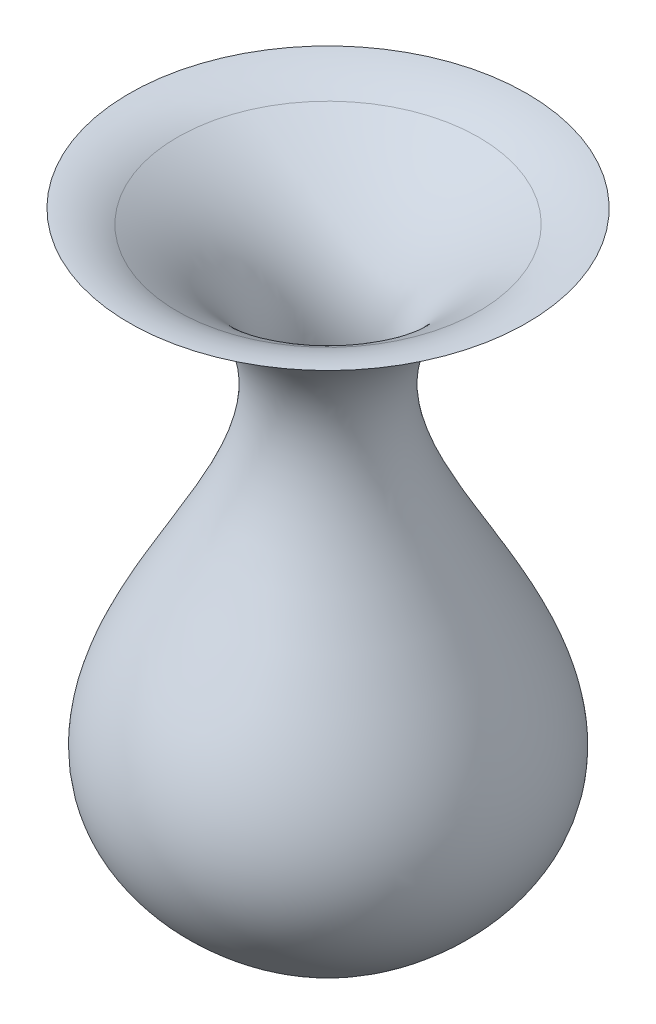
ISO-10303-21;
HEADER;
FILE_DESCRIPTION(('STEP AP214'),'2;1');
FILE_NAME('part.step','',(''),(''),'','','');
FILE_SCHEMA(('AUTOMOTIVE_DESIGN { 1 0 10303 214 1 1 1 1 }'));
ENDSEC;
DATA;
#1=APPLICATION_CONTEXT('core data for automotive mechanical design processes');
#2=APPLICATION_PROTOCOL_DEFINITION('international standard','automotive_design',2000,#1);
#3=PRODUCT_CONTEXT('',#1,'mechanical');
#4=PRODUCT('Part','Part','',(#3));
#5=PRODUCT_RELATED_PRODUCT_CATEGORY('part','',(#4));
#6=PRODUCT_DEFINITION_FORMATION('','',#4);
#7=PRODUCT_DEFINITION_CONTEXT('part definition',#1,'design');
#8=PRODUCT_DEFINITION('design','',#6,#7);
#9=PRODUCT_DEFINITION_SHAPE('','',#8);
#10=(LENGTH_UNIT() NAMED_UNIT(*) SI_UNIT(.MILLI.,.METRE.));
#11=(NAMED_UNIT(*) PLANE_ANGLE_UNIT() SI_UNIT($,.RADIAN.));
#12=(NAMED_UNIT(*) SI_UNIT($,.STERADIAN.) SOLID_ANGLE_UNIT());
#13=UNCERTAINTY_MEASURE_WITH_UNIT(LENGTH_MEASURE(1.E-05),#10,'distance_accuracy_value','');
#14=(GEOMETRIC_REPRESENTATION_CONTEXT(3) GLOBAL_UNCERTAINTY_ASSIGNED_CONTEXT((#13)) GLOBAL_UNIT_ASSIGNED_CONTEXT((#10,
#11,#12)) REPRESENTATION_CONTEXT('',''));
#15=CARTESIAN_POINT('',(0.,0.,0.));
#16=DIRECTION('',(0.,0.,1.));
#17=DIRECTION('',(1.,0.,0.));
#18=AXIS2_PLACEMENT_3D('',#15,#16,#17);
#19=CARTESIAN_POINT('',(0.,0.,0.));
#20=DIRECTION('',(0.,-1.,0.));
#21=DIRECTION('',(0.,0.,-1.));
#22=AXIS2_PLACEMENT_3D('',#19,#20,#21);
#23=PLANE('',#22);
#24=CARTESIAN_POINT('',(0.,0.,0.));
#25=DIRECTION('',(0.,-1.,0.));
#26=DIRECTION('',(0.,0.,-1.));
#27=AXIS2_PLACEMENT_3D('',#24,#25,#26);
#28=CIRCLE('',#27,10.);
#29=CARTESIAN_POINT('',(0.,0.,-10.));
#30=VERTEX_POINT('',#29);
#31=EDGE_CURVE('E51',#30,#30,#28,.T.);
#32=ORIENTED_EDGE('',*,*,#31,.T.);
#33=EDGE_LOOP('',(#32));
#34=FACE_BOUND('',#33,.T.);
#35=ADVANCED_FACE('F31',(#34),#23,.T.);
#36=CARTESIAN_POINT('',(10.,0.,0.));
#37=CARTESIAN_POINT('',(38.7773954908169,19.6098018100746,0.));
#38=CARTESIAN_POINT('',(-18.1654387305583,42.3060123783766,0.));
#39=CARTESIAN_POINT('',(20.,60.,0.));
#40=B_SPLINE_CURVE_WITH_KNOTS('',3,(#36,#37,#38,#39),.UNSPECIFIED.,.F.,.F.,(4,4),(0.,1.),.UNSPECIFIED.);
#41=CARTESIAN_POINT('',(0.,0.,0.));
#42=DIRECTION('',(0.,-1.,0.));
#43=AXIS1_PLACEMENT('',#41,#42);
#44=SURFACE_OF_REVOLUTION('',#40,#43);
#45=CARTESIAN_POINT('',(0.,60.,0.));
#46=DIRECTION('',(0.,-1.,0.));
#47=DIRECTION('',(0.,0.,-1.));
#48=AXIS2_PLACEMENT_3D('',#45,#46,#47);
#49=CIRCLE('',#48,20.);
#50=CARTESIAN_POINT('',(0.,60.,-20.));
#51=VERTEX_POINT('',#50);
#52=EDGE_CURVE('E46',#51,#51,#49,.T.);
#53=ORIENTED_EDGE('',*,*,#52,.T.);
#54=EDGE_LOOP('',(#53));
#55=FACE_BOUND('',#54,.T.);
#56=ORIENTED_EDGE('',*,*,#31,.F.);
#57=EDGE_LOOP('',(#56));
#58=FACE_BOUND('',#57,.T.);
#59=ADVANCED_FACE('F61',(#55,#58),#44,.F.);
#60=CARTESIAN_POINT('',(0.,1.,0.));
#61=DIRECTION('',(0.,-1.,0.));
#62=DIRECTION('',(0.,0.,-1.));
#63=AXIS2_PLACEMENT_3D('',#60,#61,#62);
#64=PLANE('',#63);
#65=CARTESIAN_POINT('',(0.,1.,0.));
#66=DIRECTION('',(0.,-1.,0.));
#67=DIRECTION('',(0.,0.,-1.));
#68=AXIS2_PLACEMENT_3D('',#65,#66,#67);
#69=CIRCLE('',#68,6.18170842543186);
#70=CARTESIAN_POINT('',(0.,1.,-6.18170842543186));
#71=VERTEX_POINT('',#70);
#72=EDGE_CURVE('E10',#71,#71,#69,.F.);
#73=ORIENTED_EDGE('',*,*,#72,.T.);
#74=EDGE_LOOP('',(#73));
#75=FACE_BOUND('',#74,.T.);
#76=ADVANCED_FACE('F66',(#75),#64,.F.);
#77=CARTESIAN_POINT('',(10.,0.,0.));
#78=CARTESIAN_POINT('',(38.7773954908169,19.6098018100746,0.));
#79=CARTESIAN_POINT('',(-18.1654387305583,42.3060123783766,0.));
#80=CARTESIAN_POINT('',(20.,60.,0.));
#81=B_SPLINE_CURVE_WITH_KNOTS('',3,(#77,#78,#79,#80),.UNSPECIFIED.,.F.,.F.,(4,4),(0.,1.),.UNSPECIFIED.);
#82=CARTESIAN_POINT('',(0.,0.,0.));
#83=DIRECTION('',(0.,-1.,0.));
#84=AXIS1_PLACEMENT('',#82,#83);
#85=SURFACE_OF_REVOLUTION('',#81,#84);
#86=OFFSET_SURFACE('',#85,1.,.F.);
#87=CARTESIAN_POINT('',(0.,3.90132445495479,0.));
#88=DIRECTION('',(0.,-1.,0.));
#89=DIRECTION('',(0.,0.,-1.));
#90=AXIS2_PLACEMENT_3D('',#87,#88,#89);
#91=CIRCLE('',#90,13.2250602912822);
#92=CARTESIAN_POINT('',(0.,3.90132445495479,-13.2250602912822));
#93=VERTEX_POINT('',#92);
#94=EDGE_CURVE('E38',#93,#93,#91,.T.);
#95=ORIENTED_EDGE('',*,*,#94,.T.);
#96=EDGE_LOOP('',(#95));
#97=FACE_BOUND('',#96,.T.);
#98=CARTESIAN_POINT('',(0.,58.6025579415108,0.));
#99=DIRECTION('',(0.,-1.,0.));
#100=DIRECTION('',(0.,0.,-1.));
#101=AXIS2_PLACEMENT_3D('',#98,#99,#100);
#102=CIRCLE('',#101,15.1671929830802);
#103=CARTESIAN_POINT('',(0.,58.6025579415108,-15.1671929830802));
#104=VERTEX_POINT('',#103);
#105=EDGE_CURVE('E42',#104,#104,#102,.F.);
#106=ORIENTED_EDGE('',*,*,#105,.T.);
#107=EDGE_LOOP('',(#106));
#108=FACE_BOUND('',#107,.T.);
#109=ADVANCED_FACE('F68',(#97,#108),#86,.T.);
#110=CARTESIAN_POINT('',(0.,50.0037015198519,0.));
#111=DIRECTION('',(0.,-1.,0.));
#112=DIRECTION('',(0.,0.,-1.));
#113=AXIS2_PLACEMENT_3D('',#110,#111,#112);
#114=TOROIDAL_SURFACE('',#113,20.2720600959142,10.);
#115=ORIENTED_EDGE('',*,*,#105,.F.);
#116=EDGE_LOOP('',(#115));
#117=FACE_BOUND('',#116,.T.);
#118=ORIENTED_EDGE('',*,*,#52,.F.);
#119=EDGE_LOOP('',(#118));
#120=FACE_BOUND('',#119,.T.);
#121=ADVANCED_FACE('F72',(#117,#120),#114,.T.);
#122=CARTESIAN_POINT('',(0.,11.,0.));
#123=DIRECTION('',(0.,-1.,0.));
#124=DIRECTION('',(0.,0.,-1.));
#125=AXIS2_PLACEMENT_3D('',#122,#123,#124);
#126=DEGENERATE_TOROIDAL_SURFACE('',#125,6.18170842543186,10.,.T.);
#127=ORIENTED_EDGE('',*,*,#72,.F.);
#128=EDGE_LOOP('',(#127));
#129=FACE_BOUND('',#128,.T.);
#130=ORIENTED_EDGE('',*,*,#94,.F.);
#131=EDGE_LOOP('',(#130));
#132=FACE_BOUND('',#131,.T.);
#133=ADVANCED_FACE('F33',(#129,#132),#126,.F.);
#134=CLOSED_SHELL('',(#35,#59,#76,#109,#121,#133));
#135=MANIFOLD_SOLID_BREP('B2',#134);
#136=ADVANCED_BREP_SHAPE_REPRESENTATION('',(#18,#135),#14);
#137=SHAPE_DEFINITION_REPRESENTATION(#9,#136);
ENDSEC;
END-ISO-10303-21;
